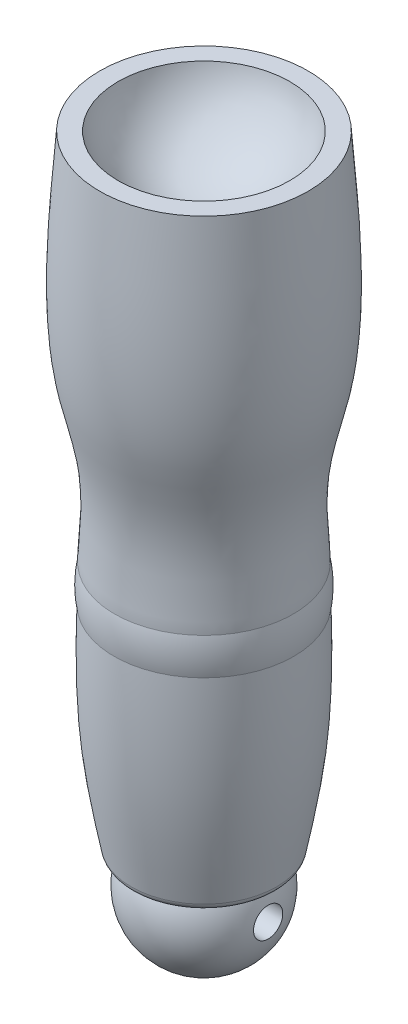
ISO-10303-21;
HEADER;
FILE_DESCRIPTION(('STEP AP214'),'2;1');
FILE_NAME('part.step','',(''),(''),'','','');
FILE_SCHEMA(('AUTOMOTIVE_DESIGN { 1 0 10303 214 1 1 1 1 }'));
ENDSEC;
DATA;
#1=APPLICATION_CONTEXT('core data for automotive mechanical design processes');
#2=APPLICATION_PROTOCOL_DEFINITION('international standard','automotive_design',2000,#1);
#3=PRODUCT_CONTEXT('',#1,'mechanical');
#4=PRODUCT('Part','Part','',(#3));
#5=PRODUCT_RELATED_PRODUCT_CATEGORY('part','',(#4));
#6=PRODUCT_DEFINITION_FORMATION('','',#4);
#7=PRODUCT_DEFINITION_CONTEXT('part definition',#1,'design');
#8=PRODUCT_DEFINITION('design','',#6,#7);
#9=PRODUCT_DEFINITION_SHAPE('','',#8);
#10=(LENGTH_UNIT() NAMED_UNIT(*) SI_UNIT(.MILLI.,.METRE.));
#11=(NAMED_UNIT(*) PLANE_ANGLE_UNIT() SI_UNIT($,.RADIAN.));
#12=(NAMED_UNIT(*) SI_UNIT($,.STERADIAN.) SOLID_ANGLE_UNIT());
#13=UNCERTAINTY_MEASURE_WITH_UNIT(LENGTH_MEASURE(1.E-05),#10,'distance_accuracy_value','');
#14=(GEOMETRIC_REPRESENTATION_CONTEXT(3) GLOBAL_UNCERTAINTY_ASSIGNED_CONTEXT((#13)) GLOBAL_UNIT_ASSIGNED_CONTEXT((#10,
#11,#12)) REPRESENTATION_CONTEXT('',''));
#15=CARTESIAN_POINT('',(0.,0.,0.));
#16=DIRECTION('',(0.,0.,1.));
#17=DIRECTION('',(1.,0.,0.));
#18=AXIS2_PLACEMENT_3D('',#15,#16,#17);
#19=CARTESIAN_POINT('',(0.,0.,0.));
#20=DIRECTION('',(0.,1.,0.));
#21=DIRECTION('',(-0.999999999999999,0.,0.));
#22=AXIS2_PLACEMENT_3D('',#19,#20,#21);
#23=PLANE('',#22);
#24=CARTESIAN_POINT('',(0.,0.,0.));
#25=DIRECTION('',(0.,1.,0.));
#26=DIRECTION('',(-0.999999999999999,0.,0.));
#27=AXIS2_PLACEMENT_3D('',#24,#25,#26);
#28=CIRCLE('',#27,34.8843045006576);
#29=CARTESIAN_POINT('',(-34.8843045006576,0.,0.));
#30=VERTEX_POINT('',#29);
#31=EDGE_CURVE('E41',#30,#30,#28,.F.);
#32=ORIENTED_EDGE('',*,*,#31,.T.);
#33=EDGE_LOOP('',(#32));
#34=FACE_BOUND('',#33,.T.);
#35=CARTESIAN_POINT('',(0.,0.,0.));
#36=DIRECTION('',(0.,1.,0.));
#37=DIRECTION('',(-0.999999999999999,0.,0.));
#38=AXIS2_PLACEMENT_3D('',#35,#36,#37);
#39=CIRCLE('',#38,32.7261363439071);
#40=CARTESIAN_POINT('',(-32.7261363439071,0.,0.));
#41=VERTEX_POINT('',#40);
#42=EDGE_CURVE('E45',#41,#41,#39,.F.);
#43=ORIENTED_EDGE('',*,*,#42,.F.);
#44=EDGE_LOOP('',(#43));
#45=FACE_BOUND('',#44,.T.);
#46=ADVANCED_FACE('F34',(#34,#45),#23,.F.);
#47=CARTESIAN_POINT('',(0.,342.,-1.11022302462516E-13));
#48=DIRECTION('',(0.,-1.,0.));
#49=DIRECTION('',(0.999999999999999,0.,0.));
#50=AXIS2_PLACEMENT_3D('',#47,#48,#49);
#51=PLANE('',#50);
#52=CARTESIAN_POINT('',(0.,342.,0.));
#53=DIRECTION('',(0.,-1.,0.));
#54=DIRECTION('',(0.999999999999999,0.,0.));
#55=AXIS2_PLACEMENT_3D('',#52,#53,#54);
#56=CIRCLE('',#55,46.946778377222);
#57=CARTESIAN_POINT('',(46.946778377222,342.,0.));
#58=VERTEX_POINT('',#57);
#59=EDGE_CURVE('E52',#58,#58,#56,.T.);
#60=ORIENTED_EDGE('',*,*,#59,.T.);
#61=EDGE_LOOP('',(#60));
#62=FACE_BOUND('',#61,.T.);
#63=CARTESIAN_POINT('',(0.,342.,-1.11022302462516E-13));
#64=DIRECTION('',(0.,-1.,0.));
#65=DIRECTION('',(0.999999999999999,0.,0.));
#66=AXIS2_PLACEMENT_3D('',#63,#64,#65);
#67=CIRCLE('',#66,57.);
#68=CARTESIAN_POINT('',(57.,342.,-1.45827794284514E-13));
#69=VERTEX_POINT('',#68);
#70=EDGE_CURVE('E49',#69,#69,#67,.T.);
#71=ORIENTED_EDGE('',*,*,#70,.F.);
#72=EDGE_LOOP('',(#71));
#73=FACE_BOUND('',#72,.T.);
#74=ADVANCED_FACE('F36',(#62,#73),#51,.F.);
#75=CARTESIAN_POINT('',(-56.9999999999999,342.,-3.33066907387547E-13));
#76=CARTESIAN_POINT('',(-60.3712096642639,299.510695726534,0.));
#77=CARTESIAN_POINT('',(-65.6354301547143,233.162681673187,0.));
#78=CARTESIAN_POINT('',(-44.6851002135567,184.285365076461,0.));
#79=CARTESIAN_POINT('',(-48.9421882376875,142.651345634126,-1.11022302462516E-13));
#80=CARTESIAN_POINT('',(-48.8512984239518,137.70138987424,0.));
#81=B_SPLINE_CURVE_WITH_KNOTS('',3,(#75,#76,#77,#78,#79,#80),.UNSPECIFIED.,.F.,.F.,(4,1,1,4),
(0.416310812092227,0.762380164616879,0.95670596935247,1.),.UNSPECIFIED.);
#82=CARTESIAN_POINT('',(0.,0.,0.));
#83=DIRECTION('',(0.,-1.,0.));
#84=AXIS1_PLACEMENT('',#82,#83);
#85=SURFACE_OF_REVOLUTION('',#81,#84);
#86=CARTESIAN_POINT('',(0.,137.70138987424,0.));
#87=DIRECTION('',(0.,-1.,0.));
#88=DIRECTION('',(0.999999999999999,0.,0.));
#89=AXIS2_PLACEMENT_3D('',#86,#87,#88);
#90=CIRCLE('',#89,48.8512984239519);
#91=CARTESIAN_POINT('',(-48.8512984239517,137.70138987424,0.));
#92=VERTEX_POINT('',#91);
#93=EDGE_CURVE('E59',#92,#92,#90,.T.);
#94=ORIENTED_EDGE('',*,*,#93,.F.);
#95=EDGE_LOOP('',(#94));
#96=FACE_BOUND('',#95,.T.);
#97=ORIENTED_EDGE('',*,*,#70,.T.);
#98=EDGE_LOOP('',(#97));
#99=FACE_BOUND('',#98,.T.);
#100=ADVANCED_FACE('F84',(#96,#99),#85,.T.);
#101=CARTESIAN_POINT('',(0.,127.045375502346,-1.11022302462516E-13));
#102=DIRECTION('',(0.,-1.,0.));
#103=DIRECTION('',(-0.999999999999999,0.,0.));
#104=AXIS2_PLACEMENT_3D('',#101,#102,#103);
#105=SPHERICAL_SURFACE('',#104,50.);
#106=CARTESIAN_POINT('',(0.,117.80371367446,-1.66533453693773E-13));
#107=DIRECTION('',(0.,-1.,0.));
#108=DIRECTION('',(0.999999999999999,0.,0.));
#109=AXIS2_PLACEMENT_3D('',#106,#107,#108);
#110=CIRCLE('',#109,49.1384949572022);
#111=CARTESIAN_POINT('',(-49.1384949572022,117.80371367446,0.));
#112=VERTEX_POINT('',#111);
#113=EDGE_CURVE('E55',#112,#112,#110,.T.);
#114=CARTESIAN_POINT('',(-49.1384949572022,117.80371367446,0.));
#115=CARTESIAN_POINT('',(-49.17706642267,118.008800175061,0.));
#116=CARTESIAN_POINT('',(-49.2143538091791,118.214128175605,0.));
#117=CARTESIAN_POINT('',(-49.2863548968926,118.625234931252,0.));
#118=CARTESIAN_POINT('',(-49.3210685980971,118.831013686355,0.));
#119=CARTESIAN_POINT('',(-49.387916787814,119.242989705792,0.));
#120=CARTESIAN_POINT('',(-49.4200512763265,119.449186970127,0.));
#121=CARTESIAN_POINT('',(-49.4817360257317,119.861967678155,0.));
#122=CARTESIAN_POINT('',(-49.5112862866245,120.068551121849,0.));
#123=CARTESIAN_POINT('',(-49.5677979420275,120.482071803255,0.));
#124=CARTESIAN_POINT('',(-49.5947593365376,120.689009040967,0.));
#125=CARTESIAN_POINT('',(-49.6460890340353,121.103204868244,0.));
#126=CARTESIAN_POINT('',(-49.6704573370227,121.310463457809,0.));
#127=CARTESIAN_POINT('',(-49.7165970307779,121.725269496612,0.));
#128=CARTESIAN_POINT('',(-49.7383684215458,121.932816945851,0.));
#129=CARTESIAN_POINT('',(-49.7793108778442,122.348168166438,0.));
#130=CARTESIAN_POINT('',(-49.7984819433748,122.555971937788,0.));
#131=CARTESIAN_POINT('',(-49.8342207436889,122.971803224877,0.));
#132=CARTESIAN_POINT('',(-49.8507884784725,123.179830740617,0.));
#133=CARTESIAN_POINT('',(-49.8813180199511,123.596076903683,0.));
#134=CARTESIAN_POINT('',(-49.8952798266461,123.80429555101,0.));
#135=CARTESIAN_POINT('',(-49.9205953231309,124.220891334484,0.));
#136=CARTESIAN_POINT('',(-49.9319490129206,124.429268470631,0.));
#137=CARTESIAN_POINT('',(-49.9520464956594,124.846148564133,0.));
#138=CARTESIAN_POINT('',(-49.9607902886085,125.054651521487,0.));
#139=CARTESIAN_POINT('',(-49.9756666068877,125.471750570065,0.));
#140=CARTESIAN_POINT('',(-49.9817991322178,125.680346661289,0.));
#141=CARTESIAN_POINT('',(-49.9914519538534,126.097599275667,0.));
#142=CARTESIAN_POINT('',(-49.9949722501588,126.30625579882,0.));
#143=CARTESIAN_POINT('',(-49.9994000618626,126.723596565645,0.));
#144=CARTESIAN_POINT('',(-50.0003075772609,126.932280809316,0.));
#145=CARTESIAN_POINT('',(-49.9995096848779,127.349644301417,0.));
#146=CARTESIAN_POINT('',(-49.9978042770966,127.558323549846,0.));
#147=CARTESIAN_POINT('',(-49.9917808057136,127.975644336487,0.));
#148=CARTESIAN_POINT('',(-49.987462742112,128.184285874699,0.));
#149=CARTESIAN_POINT('',(-49.9762146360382,128.601498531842,0.));
#150=CARTESIAN_POINT('',(-49.9692845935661,128.810069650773,0.));
#151=CARTESIAN_POINT('',(-49.9528136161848,129.22710877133,0.));
#152=CARTESIAN_POINT('',(-49.9432726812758,129.435576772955,0.));
#153=CARTESIAN_POINT('',(-49.9215814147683,129.852376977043,0.));
#154=CARTESIAN_POINT('',(-49.9094310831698,130.060709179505,0.));
#155=CARTESIAN_POINT('',(-49.8825229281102,130.477205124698,0.));
#156=CARTESIAN_POINT('',(-49.867765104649,130.685368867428,0.));
#157=CARTESIAN_POINT('',(-49.8356442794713,131.101495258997,0.));
#158=CARTESIAN_POINT('',(-49.8182812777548,131.309457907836,0.));
#159=CARTESIAN_POINT('',(-49.7809528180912,131.72514950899,0.));
#160=CARTESIAN_POINT('',(-49.760987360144,131.932878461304,0.));
#161=CARTESIAN_POINT('',(-49.7184571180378,132.348070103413,0.));
#162=CARTESIAN_POINT('',(-49.6958923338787,132.555532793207,0.));
#163=CARTESIAN_POINT('',(-49.6481669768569,132.970159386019,0.));
#164=CARTESIAN_POINT('',(-49.6230064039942,133.177323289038,0.));
#165=CARTESIAN_POINT('',(-49.5700934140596,133.591319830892,0.));
#166=CARTESIAN_POINT('',(-49.5423409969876,133.798152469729,0.));
#167=CARTESIAN_POINT('',(-49.4842486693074,134.211454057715,0.));
#168=CARTESIAN_POINT('',(-49.4539087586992,134.417923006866,0.));
#169=CARTESIAN_POINT('',(-49.3906462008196,134.830464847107,0.));
#170=CARTESIAN_POINT('',(-49.3577235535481,135.036537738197,0.));
#171=CARTESIAN_POINT('',(-49.289300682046,135.448255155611,0.));
#172=CARTESIAN_POINT('',(-49.2538004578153,135.653899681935,0.));
#173=CARTESIAN_POINT('',(-49.1802280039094,136.064728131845,0.));
#174=CARTESIAN_POINT('',(-49.1421557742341,136.269912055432,0.));
#175=CARTESIAN_POINT('',(-49.0634452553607,136.679787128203,0.));
#176=CARTESIAN_POINT('',(-49.0228069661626,136.884478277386,0.));
#177=CARTESIAN_POINT('',(-48.9389707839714,137.293335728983,0.));
#178=CARTESIAN_POINT('',(-48.8957728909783,137.497502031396,0.));
#179=CARTESIAN_POINT('',(-48.8512984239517,137.70138987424,0.));
#180=B_SPLINE_CURVE_WITH_KNOTS('',3,(#114,#115,#116,#117,#118,#119,#120,#121,#122,#123,#124,
#125,#126,#127,#128,#129,#130,#131,#132,#133,#134,#135,#136,#137,#138,#139,#140,#141,#142,#143,
#144,#145,#146,#147,#148,#149,#150,#151,#152,#153,#154,#155,#156,#157,#158,#159,#160,#161,#162,
#163,#164,#165,#166,#167,#168,#169,#170,#171,#172,#173,#174,#175,#176,#177,#178,#179),
.UNSPECIFIED.,.F.,.F.,(4,2,2,2,2,2,2,2,2,2,2,2,2,2,2,2,2,2,2,2,2,2,2,2,2,2,2,2,2,2,2,2,4),(0.,
0.626042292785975,1.25208458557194,1.8781268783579,2.50416917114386,3.13021146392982,
3.75625375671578,4.38229604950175,5.00833834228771,5.63438063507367,6.26042292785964,
6.8864652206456,7.51250751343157,8.13854980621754,8.76459209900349,9.39063439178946,
10.0166766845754,10.6427189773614,11.2687612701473,11.8948035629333,12.5208458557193,
13.1468881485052,13.7729304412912,14.3989727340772,15.0250150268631,15.6510573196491,
16.2770996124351,16.903141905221,17.529184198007,18.1552264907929,18.7812687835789,
19.4073110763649,20.0333533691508),.UNSPECIFIED.);
#181=EDGE_CURVE('BSEAM81',#112,#92,#180,.T.);
#182=ORIENTED_EDGE('',*,*,#113,.F.);
#183=ORIENTED_EDGE('',*,*,#93,.T.);
#184=ORIENTED_EDGE('',*,*,#181,.T.);
#185=ORIENTED_EDGE('',*,*,#181,.F.);
#186=EDGE_LOOP('',(#182,#184,#183,#185));
#187=FACE_BOUND('',#186,.T.);
#188=ADVANCED_FACE('F81',(#187),#105,.T.);
#189=CARTESIAN_POINT('',(-49.1384949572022,117.80371367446,-1.11022302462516E-13));
#190=CARTESIAN_POINT('',(-49.8128388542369,98.5414070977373,-2.22044604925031E-13));
#191=CARTESIAN_POINT('',(-49.5676751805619,53.893922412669,0.));
#192=CARTESIAN_POINT('',(-42.4936643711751,17.8172846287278,-1.66533453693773E-13));
#193=CARTESIAN_POINT('',(-39.,-1.11022302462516E-13,0.));
#194=B_SPLINE_CURVE_WITH_KNOTS('',3,(#189,#190,#191,#192,#193),.UNSPECIFIED.,.F.,.F.,(4,1,4),
(0.,0.167864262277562,0.331664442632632),.UNSPECIFIED.);
#195=CARTESIAN_POINT('',(0.,0.,0.));
#196=DIRECTION('',(0.,-1.,0.));
#197=AXIS1_PLACEMENT('',#195,#196);
#198=SURFACE_OF_REVOLUTION('',#194,#197);
#199=CARTESIAN_POINT('',(0.,4.04104969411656,-1.11022302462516E-13));
#200=DIRECTION('',(0.,-1.,0.));
#201=DIRECTION('',(0.999999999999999,0.,0.));
#202=AXIS2_PLACEMENT_3D('',#199,#200,#201);
#203=CIRCLE('',#202,39.7914843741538);
#204=CARTESIAN_POINT('',(39.7914843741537,4.04104969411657,-1.35319884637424E-13));
#205=VERTEX_POINT('',#204);
#206=EDGE_CURVE('E10',#205,#205,#203,.F.);
#207=ORIENTED_EDGE('',*,*,#206,.T.);
#208=EDGE_LOOP('',(#207));
#209=FACE_BOUND('',#208,.T.);
#210=ORIENTED_EDGE('',*,*,#113,.T.);
#211=EDGE_LOOP('',(#210));
#212=FACE_BOUND('',#211,.T.);
#213=ADVANCED_FACE('F76',(#209,#212),#198,.T.);
#214=CARTESIAN_POINT('',(0.,352.000000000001,0.));
#215=DIRECTION('',(0.,-1.,0.));
#216=DIRECTION('',(-1.,0.,0.));
#217=AXIS2_PLACEMENT_3D('',#214,#215,#216);
#218=SPHERICAL_SURFACE('',#217,48.);
#219=ORIENTED_EDGE('',*,*,#59,.F.);
#220=EDGE_LOOP('',(#219));
#221=FACE_BOUND('',#220,.T.);
#222=ADVANCED_FACE('F80',(#221),#218,.F.);
#223=CARTESIAN_POINT('',(0.,-15.,0.));
#224=DIRECTION('',(-1.,0.,0.));
#225=DIRECTION('',(0.,1.,0.));
#226=AXIS2_PLACEMENT_3D('',#223,#224,#225);
#227=SPHERICAL_SURFACE('',#226,36.);
#228=CARTESIAN_POINT('',(35.0998575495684,-15.0000000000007,-1.11022302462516E-13));
#229=DIRECTION('',(-1.,0.,0.));
#230=DIRECTION('',(0.,0.,1.));
#231=AXIS2_PLACEMENT_3D('',#228,#229,#230);
#232=CIRCLE('',#231,7.99999999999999);
#233=CARTESIAN_POINT('',(35.0998575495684,-15.0000000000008,7.99999999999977));
#234=VERTEX_POINT('',#233);
#235=EDGE_CURVE('E168',#234,#234,#232,.T.);
#236=ORIENTED_EDGE('',*,*,#235,.T.);
#237=EDGE_LOOP('',(#236));
#238=FACE_BOUND('',#237,.T.);
#239=CARTESIAN_POINT('',(-35.0998575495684,-15.0000000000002,-1.11022302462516E-13));
#240=DIRECTION('',(-1.,0.,0.));
#241=DIRECTION('',(0.,0.,1.));
#242=AXIS2_PLACEMENT_3D('',#239,#240,#241);
#243=CIRCLE('',#242,7.99999999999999);
#244=CARTESIAN_POINT('',(-35.0998575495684,-15.0000000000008,7.99999999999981));
#245=VERTEX_POINT('',#244);
#246=EDGE_CURVE('E56',#245,#245,#243,.T.);
#247=ORIENTED_EDGE('',*,*,#246,.F.);
#248=EDGE_LOOP('',(#247));
#249=FACE_BOUND('',#248,.T.);
#250=ORIENTED_EDGE('',*,*,#42,.T.);
#251=EDGE_LOOP('',(#250));
#252=FACE_BOUND('',#251,.T.);
#253=ADVANCED_FACE('F100',(#238,#249,#252),#227,.T.);
#254=CARTESIAN_POINT('',(-63.1625399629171,-15.0000000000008,-1.66533453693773E-13));
#255=DIRECTION('',(-1.,0.,0.));
#256=DIRECTION('',(0.,0.,1.));
#257=AXIS2_PLACEMENT_3D('',#254,#255,#256);
#258=CYLINDRICAL_SURFACE('',#257,7.99999999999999);
#259=CARTESIAN_POINT('',(35.0998575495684,-15.0000000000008,7.99999999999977));
#260=CARTESIAN_POINT('',(34.3686105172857,-15.0000000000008,7.99999999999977));
#261=CARTESIAN_POINT('',(33.637363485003,-15.0000000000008,7.99999999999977));
#262=CARTESIAN_POINT('',(32.1748694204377,-15.0000000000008,7.99999999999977));
#263=CARTESIAN_POINT('',(31.443622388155,-15.0000000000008,7.99999999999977));
#264=CARTESIAN_POINT('',(29.9811283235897,-15.0000000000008,7.99999999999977));
#265=CARTESIAN_POINT('',(29.249881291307,-15.0000000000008,7.99999999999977));
#266=CARTESIAN_POINT('',(27.7873872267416,-15.0000000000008,7.99999999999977));
#267=CARTESIAN_POINT('',(27.056140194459,-15.0000000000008,7.99999999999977));
#268=CARTESIAN_POINT('',(25.5936461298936,-15.0000000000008,7.99999999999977));
#269=CARTESIAN_POINT('',(24.8623990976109,-15.0000000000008,7.99999999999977));
#270=CARTESIAN_POINT('',(23.3999050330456,-15.0000000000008,7.99999999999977));
#271=CARTESIAN_POINT('',(22.6686580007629,-15.0000000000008,7.99999999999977));
#272=CARTESIAN_POINT('',(21.2061639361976,-15.0000000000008,7.99999999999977));
#273=CARTESIAN_POINT('',(20.4749169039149,-15.0000000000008,7.99999999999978));
#274=CARTESIAN_POINT('',(19.0124228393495,-15.0000000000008,7.99999999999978));
#275=CARTESIAN_POINT('',(18.2811758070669,-15.0000000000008,7.99999999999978));
#276=CARTESIAN_POINT('',(16.8186817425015,-15.0000000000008,7.99999999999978));
#277=CARTESIAN_POINT('',(16.0874347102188,-15.0000000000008,7.99999999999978));
#278=CARTESIAN_POINT('',(14.6249406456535,-15.0000000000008,7.99999999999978));
#279=CARTESIAN_POINT('',(13.8936936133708,-15.0000000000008,7.99999999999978));
#280=CARTESIAN_POINT('',(12.4311995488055,-15.0000000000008,7.99999999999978));
#281=CARTESIAN_POINT('',(11.6999525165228,-15.0000000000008,7.99999999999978));
#282=CARTESIAN_POINT('',(10.2374584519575,-15.0000000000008,7.99999999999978));
#283=CARTESIAN_POINT('',(9.50621141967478,-15.0000000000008,7.99999999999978));
#284=CARTESIAN_POINT('',(8.04371735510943,-15.0000000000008,7.99999999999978));
#285=CARTESIAN_POINT('',(7.31247032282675,-15.0000000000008,7.99999999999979));
#286=CARTESIAN_POINT('',(5.8499762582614,-15.0000000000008,7.99999999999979));
#287=CARTESIAN_POINT('',(5.11872922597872,-15.0000000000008,7.99999999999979));
#288=CARTESIAN_POINT('',(3.65623516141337,-15.0000000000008,7.99999999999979));
#289=CARTESIAN_POINT('',(2.92498812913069,-15.0000000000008,7.99999999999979));
#290=CARTESIAN_POINT('',(1.46249406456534,-15.0000000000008,7.99999999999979));
#291=CARTESIAN_POINT('',(0.731247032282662,-15.0000000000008,7.99999999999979));
#292=CARTESIAN_POINT('',(-0.73124703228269,-15.0000000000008,7.99999999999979));
#293=CARTESIAN_POINT('',(-1.46249406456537,-15.0000000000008,7.99999999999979));
#294=CARTESIAN_POINT('',(-2.92498812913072,-15.0000000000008,7.99999999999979));
#295=CARTESIAN_POINT('',(-3.6562351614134,-15.0000000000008,7.99999999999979));
#296=CARTESIAN_POINT('',(-5.11872922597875,-15.0000000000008,7.99999999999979));
#297=CARTESIAN_POINT('',(-5.84997625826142,-15.0000000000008,7.99999999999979));
#298=CARTESIAN_POINT('',(-7.31247032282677,-15.0000000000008,7.99999999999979));
#299=CARTESIAN_POINT('',(-8.04371735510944,-15.0000000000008,7.9999999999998));
#300=CARTESIAN_POINT('',(-9.50621141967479,-15.0000000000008,7.9999999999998));
#301=CARTESIAN_POINT('',(-10.2374584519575,-15.0000000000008,7.9999999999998));
#302=CARTESIAN_POINT('',(-11.6999525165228,-15.0000000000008,7.9999999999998));
#303=CARTESIAN_POINT('',(-12.4311995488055,-15.0000000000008,7.9999999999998));
#304=CARTESIAN_POINT('',(-13.8936936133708,-15.0000000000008,7.9999999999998));
#305=CARTESIAN_POINT('',(-14.6249406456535,-15.0000000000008,7.9999999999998));
#306=CARTESIAN_POINT('',(-16.0874347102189,-15.0000000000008,7.9999999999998));
#307=CARTESIAN_POINT('',(-16.8186817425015,-15.0000000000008,7.9999999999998));
#308=CARTESIAN_POINT('',(-18.2811758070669,-15.0000000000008,7.9999999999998));
#309=CARTESIAN_POINT('',(-19.0124228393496,-15.0000000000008,7.9999999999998));
#310=CARTESIAN_POINT('',(-20.4749169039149,-15.0000000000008,7.9999999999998));
#311=CARTESIAN_POINT('',(-21.2061639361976,-15.0000000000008,7.9999999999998));
#312=CARTESIAN_POINT('',(-22.6686580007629,-15.0000000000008,7.9999999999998));
#313=CARTESIAN_POINT('',(-23.3999050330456,-15.0000000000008,7.99999999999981));
#314=CARTESIAN_POINT('',(-24.862399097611,-15.0000000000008,7.99999999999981));
#315=CARTESIAN_POINT('',(-25.5936461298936,-15.0000000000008,7.99999999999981));
#316=CARTESIAN_POINT('',(-27.056140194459,-15.0000000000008,7.99999999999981));
#317=CARTESIAN_POINT('',(-27.7873872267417,-15.0000000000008,7.99999999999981));
#318=CARTESIAN_POINT('',(-29.249881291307,-15.0000000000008,7.99999999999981));
#319=CARTESIAN_POINT('',(-29.9811283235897,-15.0000000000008,7.99999999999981));
#320=CARTESIAN_POINT('',(-31.443622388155,-15.0000000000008,7.99999999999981));
#321=CARTESIAN_POINT('',(-32.1748694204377,-15.0000000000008,7.99999999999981));
#322=CARTESIAN_POINT('',(-33.6373634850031,-15.0000000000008,7.99999999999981));
#323=CARTESIAN_POINT('',(-34.3686105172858,-15.0000000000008,7.99999999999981));
#324=CARTESIAN_POINT('',(-35.0998575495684,-15.0000000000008,7.99999999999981));
#325=B_SPLINE_CURVE_WITH_KNOTS('',3,(#259,#260,#261,#262,#263,#264,#265,#266,#267,#268,#269,
#270,#271,#272,#273,#274,#275,#276,#277,#278,#279,#280,#281,#282,#283,#284,#285,#286,#287,#288,
#289,#290,#291,#292,#293,#294,#295,#296,#297,#298,#299,#300,#301,#302,#303,#304,#305,#306,#307,
#308,#309,#310,#311,#312,#313,#314,#315,#316,#317,#318,#319,#320,#321,#322,#323,#324),
.UNSPECIFIED.,.F.,.F.,(4,2,2,2,2,2,2,2,2,2,2,2,2,2,2,2,2,2,2,2,2,2,2,2,2,2,2,2,2,2,2,2,4),(0.,
2.19374109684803,4.38748219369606,6.58122329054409,8.77496438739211,10.9687054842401,
13.1624465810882,15.3561876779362,17.5499287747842,19.7436698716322,21.9374109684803,
24.1311520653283,26.3248931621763,28.5186342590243,30.7123753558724,32.9061164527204,
35.0998575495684,37.2935986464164,39.4873397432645,41.6810808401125,43.8748219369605,
46.0685630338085,48.2623041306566,50.4560452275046,52.6497863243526,54.8435274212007,
57.0372685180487,59.2310096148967,61.4247507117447,63.6184918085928,65.8122329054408,
68.0059740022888,70.1997150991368),.UNSPECIFIED.);
#326=EDGE_CURVE('BSEAM102',#234,#245,#325,.T.);
#327=ORIENTED_EDGE('',*,*,#235,.F.);
#328=ORIENTED_EDGE('',*,*,#246,.T.);
#329=ORIENTED_EDGE('',*,*,#326,.T.);
#330=ORIENTED_EDGE('',*,*,#326,.F.);
#331=EDGE_LOOP('',(#327,#329,#328,#330));
#332=FACE_BOUND('',#331,.T.);
#333=ADVANCED_FACE('F102',(#332),#258,.F.);
#334=CARTESIAN_POINT('',(0.,5.,0.));
#335=DIRECTION('',(0.,-1.,0.));
#336=DIRECTION('',(0.999999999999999,0.,0.));
#337=AXIS2_PLACEMENT_3D('',#334,#335,#336);
#338=TOROIDAL_SURFACE('',#337,34.8843045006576,5.);
#339=ORIENTED_EDGE('',*,*,#206,.F.);
#340=EDGE_LOOP('',(#339));
#341=FACE_BOUND('',#340,.T.);
#342=ORIENTED_EDGE('',*,*,#31,.F.);
#343=EDGE_LOOP('',(#342));
#344=FACE_BOUND('',#343,.T.);
#345=ADVANCED_FACE('F109',(#341,#344),#338,.T.);
#346=CLOSED_SHELL('',(#46,#74,#100,#188,#213,#222,#253,#333,#345));
#347=MANIFOLD_SOLID_BREP('B2',#346);
#348=ADVANCED_BREP_SHAPE_REPRESENTATION('',(#18,#347),#14);
#349=SHAPE_DEFINITION_REPRESENTATION(#9,#348);
ENDSEC;
END-ISO-10303-21;
